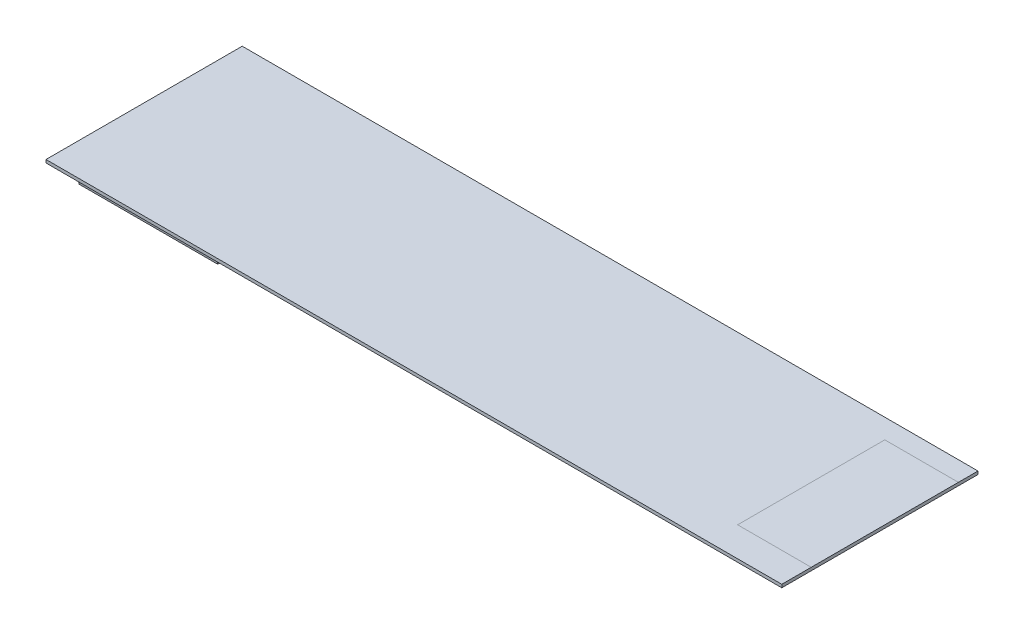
ISO-10303-21;
HEADER;
FILE_DESCRIPTION(('STEP AP214'),'2;1');
FILE_NAME('part.step','',(''),(''),'','','');
FILE_SCHEMA(('AUTOMOTIVE_DESIGN { 1 0 10303 214 1 1 1 1 }'));
ENDSEC;
DATA;
#1=APPLICATION_CONTEXT('core data for automotive mechanical design processes');
#2=APPLICATION_PROTOCOL_DEFINITION('international standard','automotive_design',2000,#1);
#3=PRODUCT_CONTEXT('',#1,'mechanical');
#4=PRODUCT('Part','Part','',(#3));
#5=PRODUCT_RELATED_PRODUCT_CATEGORY('part','',(#4));
#6=PRODUCT_DEFINITION_FORMATION('','',#4);
#7=PRODUCT_DEFINITION_CONTEXT('part definition',#1,'design');
#8=PRODUCT_DEFINITION('design','',#6,#7);
#9=PRODUCT_DEFINITION_SHAPE('','',#8);
#10=(LENGTH_UNIT() NAMED_UNIT(*) SI_UNIT(.MILLI.,.METRE.));
#11=(NAMED_UNIT(*) PLANE_ANGLE_UNIT() SI_UNIT($,.RADIAN.));
#12=(NAMED_UNIT(*) SI_UNIT($,.STERADIAN.) SOLID_ANGLE_UNIT());
#13=UNCERTAINTY_MEASURE_WITH_UNIT(LENGTH_MEASURE(1.E-05),#10,'distance_accuracy_value','');
#14=(GEOMETRIC_REPRESENTATION_CONTEXT(3) GLOBAL_UNCERTAINTY_ASSIGNED_CONTEXT((#13)) GLOBAL_UNIT_ASSIGNED_CONTEXT((#10,
#11,#12)) REPRESENTATION_CONTEXT('',''));
#15=CARTESIAN_POINT('',(0.,0.,0.));
#16=DIRECTION('',(0.,0.,1.));
#17=DIRECTION('',(1.,0.,0.));
#18=AXIS2_PLACEMENT_3D('',#15,#16,#17);
#19=CARTESIAN_POINT('',(0.,12.7,-812.8));
#20=DIRECTION('',(0.,-1.,0.));
#21=DIRECTION('',(0.,0.,-1.));
#22=AXIS2_PLACEMENT_3D('',#19,#20,#21);
#23=PLANE('',#22);
#24=DIRECTION('',(-1.,0.,0.));
#25=VECTOR('',#24,1.);
#26=CARTESIAN_POINT('',(0.,12.7,-731.52));
#27=LINE('',#26,#25);
#28=CARTESIAN_POINT('',(3048.,12.7,-731.52));
#29=VERTEX_POINT('',#28);
#30=CARTESIAN_POINT('',(2743.2,12.7,-731.52));
#31=VERTEX_POINT('',#30);
#32=EDGE_CURVE('E11',#29,#31,#27,.T.);
#33=ORIENTED_EDGE('',*,*,#32,.F.);
#34=DIRECTION('',(0.,0.,-1.));
#35=VECTOR('',#34,1.);
#36=CARTESIAN_POINT('',(3048.,12.7,0.));
#37=LINE('',#36,#35);
#38=CARTESIAN_POINT('',(3048.,12.7,-812.8));
#39=VERTEX_POINT('',#38);
#40=EDGE_CURVE('E216',#29,#39,#37,.T.);
#41=ORIENTED_EDGE('',*,*,#40,.T.);
#42=DIRECTION('',(-1.,0.,0.));
#43=VECTOR('',#42,1.);
#44=CARTESIAN_POINT('',(0.,12.7,-812.8));
#45=LINE('',#44,#43);
#46=CARTESIAN_POINT('',(0.,12.7,-812.8));
#47=VERTEX_POINT('',#46);
#48=EDGE_CURVE('E220',#39,#47,#45,.T.);
#49=ORIENTED_EDGE('',*,*,#48,.T.);
#50=DIRECTION('',(0.,0.,1.));
#51=VECTOR('',#50,1.);
#52=CARTESIAN_POINT('',(0.,12.7,0.));
#53=LINE('',#52,#51);
#54=CARTESIAN_POINT('',(0.,12.7,0.));
#55=VERTEX_POINT('',#54);
#56=EDGE_CURVE('E210',#47,#55,#53,.T.);
#57=ORIENTED_EDGE('',*,*,#56,.T.);
#58=DIRECTION('',(1.,0.,0.));
#59=VECTOR('',#58,1.);
#60=CARTESIAN_POINT('',(0.,12.7,0.));
#61=LINE('',#60,#59);
#62=CARTESIAN_POINT('',(3048.,12.7,0.));
#63=VERTEX_POINT('',#62);
#64=EDGE_CURVE('E213',#55,#63,#61,.T.);
#65=ORIENTED_EDGE('',*,*,#64,.T.);
#66=CARTESIAN_POINT('',(3048.,12.7,-121.92));
#67=VERTEX_POINT('',#66);
#68=EDGE_CURVE('E217',#63,#67,#37,.T.);
#69=ORIENTED_EDGE('',*,*,#68,.T.);
#70=DIRECTION('',(1.,0.,0.));
#71=VECTOR('',#70,1.);
#72=CARTESIAN_POINT('',(0.,12.7,-121.92));
#73=LINE('',#72,#71);
#74=CARTESIAN_POINT('',(2743.2,12.7,-121.92));
#75=VERTEX_POINT('',#74);
#76=EDGE_CURVE('E248',#75,#67,#73,.T.);
#77=ORIENTED_EDGE('',*,*,#76,.F.);
#78=DIRECTION('',(0.,0.,1.));
#79=VECTOR('',#78,1.);
#80=CARTESIAN_POINT('',(2743.2,12.7,-812.8));
#81=LINE('',#80,#79);
#82=EDGE_CURVE('E51',#31,#75,#81,.T.);
#83=ORIENTED_EDGE('',*,*,#82,.F.);
#84=EDGE_LOOP('',(#33,#41,#49,#57,#65,#69,#77,#83));
#85=FACE_BOUND('',#84,.T.);
#86=ADVANCED_FACE('F42',(#85),#23,.F.);
#87=CARTESIAN_POINT('',(0.,12.7,0.));
#88=DIRECTION('',(1.,0.,0.));
#89=DIRECTION('',(0.,0.,-1.));
#90=AXIS2_PLACEMENT_3D('',#87,#88,#89);
#91=PLANE('',#90);
#92=DIRECTION('',(0.,0.,1.));
#93=VECTOR('',#92,1.);
#94=CARTESIAN_POINT('',(0.,0.,0.));
#95=LINE('',#94,#93);
#96=CARTESIAN_POINT('',(0.,0.,-812.8));
#97=VERTEX_POINT('',#96);
#98=CARTESIAN_POINT('',(0.,0.,-711.2));
#99=VERTEX_POINT('',#98);
#100=EDGE_CURVE('E224',#97,#99,#95,.T.);
#101=ORIENTED_EDGE('',*,*,#100,.T.);
#102=DIRECTION('',(0.,0.,-1.));
#103=VECTOR('',#102,1.);
#104=CARTESIAN_POINT('',(0.,0.,-711.2));
#105=LINE('',#104,#103);
#106=CARTESIAN_POINT('',(0.,0.,-101.6));
#107=VERTEX_POINT('',#106);
#108=EDGE_CURVE('E180',#107,#99,#105,.T.);
#109=ORIENTED_EDGE('',*,*,#108,.F.);
#110=CARTESIAN_POINT('',(0.,0.,0.));
#111=VERTEX_POINT('',#110);
#112=EDGE_CURVE('E190',#107,#111,#95,.T.);
#113=ORIENTED_EDGE('',*,*,#112,.T.);
#114=DIRECTION('',(0.,-1.,0.));
#115=VECTOR('',#114,1.);
#116=CARTESIAN_POINT('',(0.,12.7,0.));
#117=LINE('',#116,#115);
#118=EDGE_CURVE('E240',#55,#111,#117,.T.);
#119=ORIENTED_EDGE('',*,*,#118,.F.);
#120=ORIENTED_EDGE('',*,*,#56,.F.);
#121=DIRECTION('',(0.,-1.,0.));
#122=VECTOR('',#121,1.);
#123=CARTESIAN_POINT('',(0.,12.7,-812.8));
#124=LINE('',#123,#122);
#125=EDGE_CURVE('E223',#47,#97,#124,.T.);
#126=ORIENTED_EDGE('',*,*,#125,.T.);
#127=EDGE_LOOP('',(#101,#109,#113,#119,#120,#126));
#128=FACE_BOUND('',#127,.T.);
#129=ADVANCED_FACE('F44',(#128),#91,.F.);
#130=CARTESIAN_POINT('',(0.,12.7,0.));
#131=DIRECTION('',(0.,0.,-1.));
#132=DIRECTION('',(-1.,0.,0.));
#133=AXIS2_PLACEMENT_3D('',#130,#131,#132);
#134=PLANE('',#133);
#135=DIRECTION('',(1.,0.,0.));
#136=VECTOR('',#135,1.);
#137=CARTESIAN_POINT('',(0.,0.,0.));
#138=LINE('',#137,#136);
#139=CARTESIAN_POINT('',(3048.,0.,0.));
#140=VERTEX_POINT('',#139);
#141=EDGE_CURVE('E227',#111,#140,#138,.T.);
#142=ORIENTED_EDGE('',*,*,#141,.T.);
#143=DIRECTION('',(0.,-1.,0.));
#144=VECTOR('',#143,1.);
#145=CARTESIAN_POINT('',(3048.,12.7,0.));
#146=LINE('',#145,#144);
#147=EDGE_CURVE('E237',#63,#140,#146,.T.);
#148=ORIENTED_EDGE('',*,*,#147,.F.);
#149=ORIENTED_EDGE('',*,*,#64,.F.);
#150=ORIENTED_EDGE('',*,*,#118,.T.);
#151=EDGE_LOOP('',(#142,#148,#149,#150));
#152=FACE_BOUND('',#151,.T.);
#153=ADVANCED_FACE('F269',(#152),#134,.F.);
#154=CARTESIAN_POINT('',(3048.,12.7,0.));
#155=DIRECTION('',(-1.,0.,0.));
#156=DIRECTION('',(0.,0.,1.));
#157=AXIS2_PLACEMENT_3D('',#154,#155,#156);
#158=PLANE('',#157);
#159=DIRECTION('',(0.,0.,-1.));
#160=VECTOR('',#159,1.);
#161=CARTESIAN_POINT('',(3048.,0.,0.));
#162=LINE('',#161,#160);
#163=CARTESIAN_POINT('',(3048.,0.,-812.8));
#164=VERTEX_POINT('',#163);
#165=EDGE_CURVE('E229',#140,#164,#162,.T.);
#166=ORIENTED_EDGE('',*,*,#165,.T.);
#167=DIRECTION('',(0.,-1.,0.));
#168=VECTOR('',#167,1.);
#169=CARTESIAN_POINT('',(3048.,12.7,-812.8));
#170=LINE('',#169,#168);
#171=EDGE_CURVE('E234',#39,#164,#170,.T.);
#172=ORIENTED_EDGE('',*,*,#171,.F.);
#173=ORIENTED_EDGE('',*,*,#40,.F.);
#174=EDGE_CURVE('E221',#67,#29,#37,.T.);
#175=ORIENTED_EDGE('',*,*,#174,.F.);
#176=ORIENTED_EDGE('',*,*,#68,.F.);
#177=ORIENTED_EDGE('',*,*,#147,.T.);
#178=EDGE_LOOP('',(#166,#172,#173,#175,#176,#177));
#179=FACE_BOUND('',#178,.T.);
#180=ADVANCED_FACE('F263',(#179),#158,.F.);
#181=CARTESIAN_POINT('',(0.,12.7,-812.8));
#182=DIRECTION('',(0.,0.,1.));
#183=DIRECTION('',(1.,0.,0.));
#184=AXIS2_PLACEMENT_3D('',#181,#182,#183);
#185=PLANE('',#184);
#186=DIRECTION('',(-1.,0.,0.));
#187=VECTOR('',#186,1.);
#188=CARTESIAN_POINT('',(0.,0.,-812.8));
#189=LINE('',#188,#187);
#190=EDGE_CURVE('E214',#164,#97,#189,.T.);
#191=ORIENTED_EDGE('',*,*,#190,.T.);
#192=ORIENTED_EDGE('',*,*,#125,.F.);
#193=ORIENTED_EDGE('',*,*,#48,.F.);
#194=ORIENTED_EDGE('',*,*,#171,.T.);
#195=EDGE_LOOP('',(#191,#192,#193,#194));
#196=FACE_BOUND('',#195,.T.);
#197=ADVANCED_FACE('F279',(#196),#185,.F.);
#198=ORIENTED_EDGE('',*,*,#174,.T.);
#199=ORIENTED_EDGE('',*,*,#32,.T.);
#200=ORIENTED_EDGE('',*,*,#82,.T.);
#201=ORIENTED_EDGE('',*,*,#76,.T.);
#202=EDGE_LOOP('',(#198,#199,#200,#201));
#203=FACE_BOUND('',#202,.T.);
#204=ADVANCED_FACE('F258',(#203),#23,.F.);
#205=CARTESIAN_POINT('',(0.,0.,-812.8));
#206=DIRECTION('',(0.,-1.,0.));
#207=DIRECTION('',(0.,0.,-1.));
#208=AXIS2_PLACEMENT_3D('',#205,#206,#207);
#209=PLANE('',#208);
#210=DIRECTION('',(1.,0.,0.));
#211=VECTOR('',#210,1.);
#212=CARTESIAN_POINT('',(0.,0.,-711.2));
#213=LINE('',#212,#211);
#214=CARTESIAN_POINT('',(609.6,0.,-711.2));
#215=VERTEX_POINT('',#214);
#216=EDGE_CURVE('E183',#99,#215,#213,.T.);
#217=ORIENTED_EDGE('',*,*,#216,.F.);
#218=ORIENTED_EDGE('',*,*,#100,.F.);
#219=ORIENTED_EDGE('',*,*,#190,.F.);
#220=ORIENTED_EDGE('',*,*,#165,.F.);
#221=ORIENTED_EDGE('',*,*,#141,.F.);
#222=ORIENTED_EDGE('',*,*,#112,.F.);
#223=DIRECTION('',(-1.,0.,0.));
#224=VECTOR('',#223,1.);
#225=CARTESIAN_POINT('',(0.,0.,-101.6));
#226=LINE('',#225,#224);
#227=CARTESIAN_POINT('',(609.6,0.,-101.6));
#228=VERTEX_POINT('',#227);
#229=EDGE_CURVE('E177',#228,#107,#226,.T.);
#230=ORIENTED_EDGE('',*,*,#229,.F.);
#231=DIRECTION('',(0.,0.,1.));
#232=VECTOR('',#231,1.);
#233=CARTESIAN_POINT('',(609.6,0.,-711.2));
#234=LINE('',#233,#232);
#235=EDGE_CURVE('E174',#215,#228,#234,.T.);
#236=ORIENTED_EDGE('',*,*,#235,.F.);
#237=EDGE_LOOP('',(#217,#218,#219,#220,#221,#222,#230,#236));
#238=FACE_BOUND('',#237,.T.);
#239=ADVANCED_FACE('F274',(#238),#209,.T.);
#240=CARTESIAN_POINT('',(609.6,0.,-711.2));
#241=DIRECTION('',(0.99026806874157,-0.139173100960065,0.));
#242=DIRECTION('',(0.139173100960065,0.99026806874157,0.));
#243=AXIS2_PLACEMENT_3D('',#240,#241,#242);
#244=PLANE('',#243);
#245=ORIENTED_EDGE('',*,*,#235,.T.);
#246=DIRECTION('',(0.137844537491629,0.980814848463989,0.137844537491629));
#247=VECTOR('',#246,1.);
#248=CARTESIAN_POINT('',(598.016919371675,-82.417901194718,-113.183080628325));
#249=LINE('',#248,#247);
#250=CARTESIAN_POINT('',(591.751313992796,-127.,-119.448686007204));
#251=VERTEX_POINT('',#250);
#252=EDGE_CURVE('E187',#251,#228,#249,.T.);
#253=ORIENTED_EDGE('',*,*,#252,.F.);
#254=DIRECTION('',(0.,0.,-1.));
#255=VECTOR('',#254,1.);
#256=CARTESIAN_POINT('',(591.751313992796,-127.,0.));
#257=LINE('',#256,#255);
#258=CARTESIAN_POINT('',(591.751313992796,-127.,-693.351313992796));
#259=VERTEX_POINT('',#258);
#260=EDGE_CURVE('E186',#259,#251,#257,.F.);
#261=ORIENTED_EDGE('',*,*,#260,.F.);
#262=DIRECTION('',(0.137844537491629,0.980814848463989,-0.137844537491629));
#263=VECTOR('',#262,1.);
#264=CARTESIAN_POINT('',(609.6,0.,-711.2));
#265=LINE('',#264,#263);
#266=EDGE_CURVE('E192',#259,#215,#265,.T.);
#267=ORIENTED_EDGE('',*,*,#266,.T.);
#268=EDGE_LOOP('',(#245,#253,#261,#267));
#269=FACE_BOUND('',#268,.T.);
#270=ADVANCED_FACE('F297',(#269),#244,.T.);
#271=CARTESIAN_POINT('',(0.,0.,-101.6));
#272=DIRECTION('',(0.,-0.139173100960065,0.99026806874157));
#273=DIRECTION('',(0.,-0.99026806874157,-0.139173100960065));
#274=AXIS2_PLACEMENT_3D('',#271,#272,#273);
#275=PLANE('',#274);
#276=ORIENTED_EDGE('',*,*,#229,.T.);
#277=DIRECTION('',(-0.137844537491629,0.980814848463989,0.137844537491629));
#278=VECTOR('',#277,1.);
#279=CARTESIAN_POINT('',(11.5830806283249,-82.417901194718,-113.183080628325));
#280=LINE('',#279,#278);
#281=CARTESIAN_POINT('',(17.8486860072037,-127.,-119.448686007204));
#282=VERTEX_POINT('',#281);
#283=EDGE_CURVE('E191',#282,#107,#280,.T.);
#284=ORIENTED_EDGE('',*,*,#283,.F.);
#285=DIRECTION('',(1.,0.,0.));
#286=VECTOR('',#285,1.);
#287=CARTESIAN_POINT('',(0.,-127.,-119.448686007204));
#288=LINE('',#287,#286);
#289=EDGE_CURVE('E203',#251,#282,#288,.F.);
#290=ORIENTED_EDGE('',*,*,#289,.F.);
#291=ORIENTED_EDGE('',*,*,#252,.T.);
#292=EDGE_LOOP('',(#276,#284,#290,#291));
#293=FACE_BOUND('',#292,.T.);
#294=ADVANCED_FACE('F284',(#293),#275,.T.);
#295=CARTESIAN_POINT('',(0.,0.,-711.2));
#296=DIRECTION('',(-0.99026806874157,-0.139173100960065,0.));
#297=DIRECTION('',(0.139173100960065,-0.99026806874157,0.));
#298=AXIS2_PLACEMENT_3D('',#295,#296,#297);
#299=PLANE('',#298);
#300=DIRECTION('',(0.,0.,1.));
#301=VECTOR('',#300,1.);
#302=CARTESIAN_POINT('',(17.8486860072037,-127.,0.));
#303=LINE('',#302,#301);
#304=CARTESIAN_POINT('',(17.8486860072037,-127.,-584.2));
#305=VERTEX_POINT('',#304);
#306=CARTESIAN_POINT('',(17.8486860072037,-127.,-693.351313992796));
#307=VERTEX_POINT('',#306);
#308=EDGE_CURVE('E205',#305,#307,#303,.F.);
#309=ORIENTED_EDGE('',*,*,#308,.F.);
#310=DIRECTION('',(0.139173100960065,-0.99026806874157,0.));
#311=VECTOR('',#310,1.);
#312=CARTESIAN_POINT('',(0.,0.,-584.2));
#313=LINE('',#312,#311);
#314=CARTESIAN_POINT('',(12.4940802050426,-88.9,-584.2));
#315=VERTEX_POINT('',#314);
#316=EDGE_CURVE('E171',#305,#315,#313,.F.);
#317=ORIENTED_EDGE('',*,*,#316,.T.);
#318=DIRECTION('',(0.,0.,-1.));
#319=VECTOR('',#318,1.);
#320=CARTESIAN_POINT('',(12.4940802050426,-88.9,-711.2));
#321=LINE('',#320,#319);
#322=CARTESIAN_POINT('',(12.4940802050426,-88.9,-177.8));
#323=VERTEX_POINT('',#322);
#324=EDGE_CURVE('E246',#315,#323,#321,.F.);
#325=ORIENTED_EDGE('',*,*,#324,.T.);
#326=DIRECTION('',(-0.139173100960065,0.99026806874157,0.));
#327=VECTOR('',#326,1.);
#328=CARTESIAN_POINT('',(0.,0.,-177.8));
#329=LINE('',#328,#327);
#330=CARTESIAN_POINT('',(17.8486860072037,-127.,-177.8));
#331=VERTEX_POINT('',#330);
#332=EDGE_CURVE('E156',#323,#331,#329,.F.);
#333=ORIENTED_EDGE('',*,*,#332,.T.);
#334=EDGE_CURVE('E206',#282,#331,#303,.F.);
#335=ORIENTED_EDGE('',*,*,#334,.F.);
#336=ORIENTED_EDGE('',*,*,#283,.T.);
#337=ORIENTED_EDGE('',*,*,#108,.T.);
#338=DIRECTION('',(-0.137844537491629,0.980814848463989,-0.137844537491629));
#339=VECTOR('',#338,1.);
#340=CARTESIAN_POINT('',(0.,0.,-711.2));
#341=LINE('',#340,#339);
#342=EDGE_CURVE('E195',#307,#99,#341,.T.);
#343=ORIENTED_EDGE('',*,*,#342,.F.);
#344=EDGE_LOOP('',(#309,#317,#325,#333,#335,#336,#337,#343));
#345=FACE_BOUND('',#344,.T.);
#346=ADVANCED_FACE('F289',(#345),#299,.T.);
#347=CARTESIAN_POINT('',(0.,0.,-711.2));
#348=DIRECTION('',(0.,-0.139173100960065,-0.99026806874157));
#349=DIRECTION('',(0.,0.99026806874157,-0.139173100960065));
#350=AXIS2_PLACEMENT_3D('',#347,#348,#349);
#351=PLANE('',#350);
#352=ORIENTED_EDGE('',*,*,#216,.T.);
#353=ORIENTED_EDGE('',*,*,#266,.F.);
#354=DIRECTION('',(-1.,0.,0.));
#355=VECTOR('',#354,1.);
#356=CARTESIAN_POINT('',(0.,-127.,-693.351313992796));
#357=LINE('',#356,#355);
#358=EDGE_CURVE('E196',#307,#259,#357,.F.);
#359=ORIENTED_EDGE('',*,*,#358,.F.);
#360=ORIENTED_EDGE('',*,*,#342,.T.);
#361=EDGE_LOOP('',(#352,#353,#359,#360));
#362=FACE_BOUND('',#361,.T.);
#363=ADVANCED_FACE('F299',(#362),#351,.T.);
#364=CARTESIAN_POINT('',(0.,-127.,0.));
#365=DIRECTION('',(0.,1.,0.));
#366=DIRECTION('',(0.,0.,1.));
#367=AXIS2_PLACEMENT_3D('',#364,#365,#366);
#368=PLANE('',#367);
#369=DIRECTION('',(0.,0.,1.));
#370=VECTOR('',#369,1.);
#371=CARTESIAN_POINT('',(508.,-127.,-584.2));
#372=LINE('',#371,#370);
#373=CARTESIAN_POINT('',(508.,-127.,-584.2));
#374=VERTEX_POINT('',#373);
#375=CARTESIAN_POINT('',(508.,-127.,-177.8));
#376=VERTEX_POINT('',#375);
#377=EDGE_CURVE('E146',#374,#376,#372,.T.);
#378=ORIENTED_EDGE('',*,*,#377,.F.);
#379=DIRECTION('',(-1.,0.,0.));
#380=VECTOR('',#379,1.);
#381=CARTESIAN_POINT('',(0.,-127.,-584.2));
#382=LINE('',#381,#380);
#383=EDGE_CURVE('E243',#374,#305,#382,.T.);
#384=ORIENTED_EDGE('',*,*,#383,.T.);
#385=ORIENTED_EDGE('',*,*,#308,.T.);
#386=ORIENTED_EDGE('',*,*,#358,.T.);
#387=ORIENTED_EDGE('',*,*,#260,.T.);
#388=ORIENTED_EDGE('',*,*,#289,.T.);
#389=ORIENTED_EDGE('',*,*,#334,.T.);
#390=DIRECTION('',(-1.,0.,0.));
#391=VECTOR('',#390,1.);
#392=CARTESIAN_POINT('',(0.,-127.,-177.8));
#393=LINE('',#392,#391);
#394=EDGE_CURVE('E163',#376,#331,#393,.T.);
#395=ORIENTED_EDGE('',*,*,#394,.F.);
#396=EDGE_LOOP('',(#378,#384,#385,#386,#387,#388,#389,#395));
#397=FACE_BOUND('',#396,.T.);
#398=ADVANCED_FACE('F292',(#397),#368,.F.);
#399=CARTESIAN_POINT('',(0.,-88.9,0.));
#400=DIRECTION('',(0.,1.,0.));
#401=DIRECTION('',(0.,0.,1.));
#402=AXIS2_PLACEMENT_3D('',#399,#400,#401);
#403=PLANE('',#402);
#404=DIRECTION('',(1.,0.,0.));
#405=VECTOR('',#404,1.);
#406=CARTESIAN_POINT('',(0.,-88.9,-584.2));
#407=LINE('',#406,#405);
#408=CARTESIAN_POINT('',(508.,-88.9,-584.2));
#409=VERTEX_POINT('',#408);
#410=EDGE_CURVE('E150',#315,#409,#407,.T.);
#411=ORIENTED_EDGE('',*,*,#410,.T.);
#412=DIRECTION('',(0.,0.,1.));
#413=VECTOR('',#412,1.);
#414=CARTESIAN_POINT('',(508.,-88.9,-584.2));
#415=LINE('',#414,#413);
#416=CARTESIAN_POINT('',(508.,-88.9,-177.8));
#417=VERTEX_POINT('',#416);
#418=EDGE_CURVE('E144',#409,#417,#415,.T.);
#419=ORIENTED_EDGE('',*,*,#418,.T.);
#420=DIRECTION('',(-1.,0.,0.));
#421=VECTOR('',#420,1.);
#422=CARTESIAN_POINT('',(0.,-88.9,-177.8));
#423=LINE('',#422,#421);
#424=EDGE_CURVE('E153',#417,#323,#423,.T.);
#425=ORIENTED_EDGE('',*,*,#424,.T.);
#426=ORIENTED_EDGE('',*,*,#324,.F.);
#427=EDGE_LOOP('',(#411,#419,#425,#426));
#428=FACE_BOUND('',#427,.T.);
#429=ADVANCED_FACE('F160',(#428),#403,.F.);
#430=CARTESIAN_POINT('',(0.,-88.9,-584.2));
#431=DIRECTION('',(0.,0.,-1.));
#432=DIRECTION('',(-1.,0.,0.));
#433=AXIS2_PLACEMENT_3D('',#430,#431,#432);
#434=PLANE('',#433);
#435=ORIENTED_EDGE('',*,*,#383,.F.);
#436=DIRECTION('',(0.,-1.,0.));
#437=VECTOR('',#436,1.);
#438=CARTESIAN_POINT('',(508.,-88.9,-584.2));
#439=LINE('',#438,#437);
#440=EDGE_CURVE('E149',#409,#374,#439,.T.);
#441=ORIENTED_EDGE('',*,*,#440,.F.);
#442=ORIENTED_EDGE('',*,*,#410,.F.);
#443=ORIENTED_EDGE('',*,*,#316,.F.);
#444=EDGE_LOOP('',(#435,#441,#442,#443));
#445=FACE_BOUND('',#444,.T.);
#446=ADVANCED_FACE('F301',(#445),#434,.F.);
#447=CARTESIAN_POINT('',(0.,-88.9,-177.8));
#448=DIRECTION('',(0.,0.,1.));
#449=DIRECTION('',(1.,0.,0.));
#450=AXIS2_PLACEMENT_3D('',#447,#448,#449);
#451=PLANE('',#450);
#452=ORIENTED_EDGE('',*,*,#424,.F.);
#453=DIRECTION('',(0.,-1.,0.));
#454=VECTOR('',#453,1.);
#455=CARTESIAN_POINT('',(508.,-88.9,-177.8));
#456=LINE('',#455,#454);
#457=EDGE_CURVE('E139',#417,#376,#456,.T.);
#458=ORIENTED_EDGE('',*,*,#457,.T.);
#459=ORIENTED_EDGE('',*,*,#394,.T.);
#460=ORIENTED_EDGE('',*,*,#332,.F.);
#461=EDGE_LOOP('',(#452,#458,#459,#460));
#462=FACE_BOUND('',#461,.T.);
#463=ADVANCED_FACE('F154',(#462),#451,.F.);
#464=CARTESIAN_POINT('',(508.,-88.9,-584.2));
#465=DIRECTION('',(1.,0.,0.));
#466=DIRECTION('',(0.,0.,-1.));
#467=AXIS2_PLACEMENT_3D('',#464,#465,#466);
#468=PLANE('',#467);
#469=ORIENTED_EDGE('',*,*,#377,.T.);
#470=ORIENTED_EDGE('',*,*,#457,.F.);
#471=ORIENTED_EDGE('',*,*,#418,.F.);
#472=ORIENTED_EDGE('',*,*,#440,.T.);
#473=EDGE_LOOP('',(#469,#470,#471,#472));
#474=FACE_BOUND('',#473,.T.);
#475=ADVANCED_FACE('F141',(#474),#468,.F.);
#476=CLOSED_SHELL('',(#86,#129,#153,#180,#197,#204,#239,#270,#294,#346,#363,#398,#429,#446,#463,#475));
#477=MANIFOLD_SOLID_BREP('B2',#476);
#478=ADVANCED_BREP_SHAPE_REPRESENTATION('',(#18,#477),#14);
#479=SHAPE_DEFINITION_REPRESENTATION(#9,#478);
ENDSEC;
END-ISO-10303-21;
